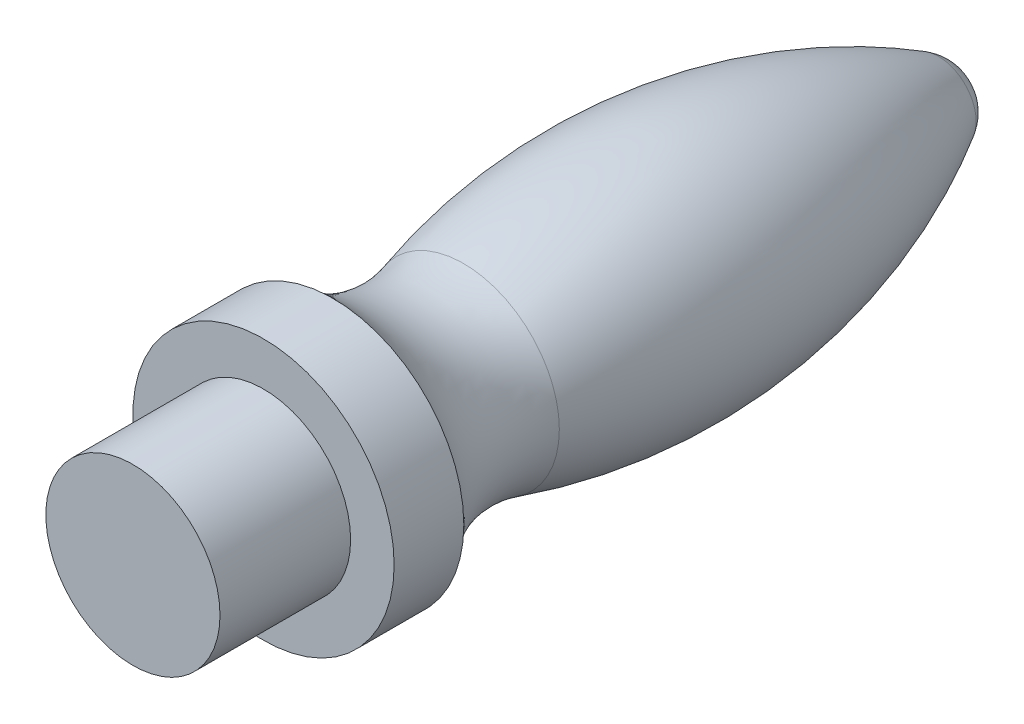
ISO-10303-21;
HEADER;
FILE_DESCRIPTION(('STEP AP214'),'2;1');
FILE_NAME('part.step','',(''),(''),'','','');
FILE_SCHEMA(('AUTOMOTIVE_DESIGN { 1 0 10303 214 1 1 1 1 }'));
ENDSEC;
DATA;
#1=APPLICATION_CONTEXT('core data for automotive mechanical design processes');
#2=APPLICATION_PROTOCOL_DEFINITION('international standard','automotive_design',2000,#1);
#3=PRODUCT_CONTEXT('',#1,'mechanical');
#4=PRODUCT('Part','Part','',(#3));
#5=PRODUCT_RELATED_PRODUCT_CATEGORY('part','',(#4));
#6=PRODUCT_DEFINITION_FORMATION('','',#4);
#7=PRODUCT_DEFINITION_CONTEXT('part definition',#1,'design');
#8=PRODUCT_DEFINITION('design','',#6,#7);
#9=PRODUCT_DEFINITION_SHAPE('','',#8);
#10=(LENGTH_UNIT() NAMED_UNIT(*) SI_UNIT(.MILLI.,.METRE.));
#11=(NAMED_UNIT(*) PLANE_ANGLE_UNIT() SI_UNIT($,.RADIAN.));
#12=(NAMED_UNIT(*) SI_UNIT($,.STERADIAN.) SOLID_ANGLE_UNIT());
#13=UNCERTAINTY_MEASURE_WITH_UNIT(LENGTH_MEASURE(1.E-05),#10,'distance_accuracy_value','');
#14=(GEOMETRIC_REPRESENTATION_CONTEXT(3) GLOBAL_UNCERTAINTY_ASSIGNED_CONTEXT((#13)) GLOBAL_UNIT_ASSIGNED_CONTEXT((#10,
#11,#12)) REPRESENTATION_CONTEXT('',''));
#15=CARTESIAN_POINT('',(0.,0.,0.));
#16=DIRECTION('',(0.,0.,1.));
#17=DIRECTION('',(1.,0.,0.));
#18=AXIS2_PLACEMENT_3D('',#15,#16,#17);
#19=CARTESIAN_POINT('',(0.,0.,-43.2663465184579));
#20=DIRECTION('',(0.,0.,1.));
#21=DIRECTION('',(0.,1.,0.));
#22=AXIS2_PLACEMENT_3D('',#19,#20,#21);
#23=SPHERICAL_SURFACE('',#22,5.);
#24=CARTESIAN_POINT('',(0.,0.,-45.7729711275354));
#25=DIRECTION('',(0.,0.,1.));
#26=DIRECTION('',(1.,0.,0.));
#27=AXIS2_PLACEMENT_3D('',#24,#25,#26);
#28=CIRCLE('',#27,4.32629553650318);
#29=CARTESIAN_POINT('',(4.32629553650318,0.,-45.7729711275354));
#30=VERTEX_POINT('',#29);
#31=EDGE_CURVE('E10',#30,#30,#28,.T.);
#32=ORIENTED_EDGE('',*,*,#31,.F.);
#33=EDGE_LOOP('',(#32));
#34=FACE_BOUND('',#33,.T.);
#35=ADVANCED_FACE('F29',(#34),#23,.T.);
#36=CARTESIAN_POINT('',(0.,0.,-10.6802266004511));
#37=DIRECTION('',(0.,0.,1.));
#38=DIRECTION('',(1.,0.,0.));
#39=AXIS2_PLACEMENT_3D('',#36,#37,#38);
#40=DEGENERATE_TOROIDAL_SURFACE('',#39,56.2418419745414,70.,.F.);
#41=CARTESIAN_POINT('',(0.,0.,8.76811348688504));
#42=DIRECTION('',(0.,0.,1.));
#43=DIRECTION('',(1.,0.,0.));
#44=AXIS2_PLACEMENT_3D('',#41,#42,#43);
#45=CIRCLE('',#44,11.0022065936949);
#46=CARTESIAN_POINT('',(11.0022065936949,0.,8.76811348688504));
#47=VERTEX_POINT('',#46);
#48=EDGE_CURVE('E35',#47,#47,#45,.T.);
#49=ORIENTED_EDGE('',*,*,#48,.F.);
#50=EDGE_LOOP('',(#49));
#51=FACE_BOUND('',#50,.T.);
#52=ORIENTED_EDGE('',*,*,#31,.T.);
#53=EDGE_LOOP('',(#52));
#54=FACE_BOUND('',#53,.T.);
#55=ADVANCED_FACE('F77',(#51,#54),#40,.F.);
#56=CARTESIAN_POINT('',(0.,0.,12.9356149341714));
#57=DIRECTION('',(0.,0.,1.));
#58=DIRECTION('',(1.,0.,0.));
#59=AXIS2_PLACEMENT_3D('',#56,#57,#58);
#60=TOROIDAL_SURFACE('',#59,25.4116455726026,15.);
#61=CARTESIAN_POINT('',(0.,0.,23.7336534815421));
#62=DIRECTION('',(0.,0.,1.));
#63=DIRECTION('',(1.,0.,0.));
#64=AXIS2_PLACEMENT_3D('',#61,#62,#63);
#65=CIRCLE('',#64,15.);
#66=CARTESIAN_POINT('',(15.,0.,23.7336534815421));
#67=VERTEX_POINT('',#66);
#68=EDGE_CURVE('E39',#67,#67,#65,.T.);
#69=ORIENTED_EDGE('',*,*,#68,.F.);
#70=EDGE_LOOP('',(#69));
#71=FACE_BOUND('',#70,.T.);
#72=ORIENTED_EDGE('',*,*,#48,.T.);
#73=EDGE_LOOP('',(#72));
#74=FACE_BOUND('',#73,.T.);
#75=ADVANCED_FACE('F72',(#71,#74),#60,.F.);
#76=CARTESIAN_POINT('',(0.,0.,68.4127456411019));
#77=DIRECTION('',(0.,0.,1.));
#78=DIRECTION('',(1.,0.,0.));
#79=AXIS2_PLACEMENT_3D('',#76,#77,#78);
#80=CYLINDRICAL_SURFACE('',#79,15.);
#81=CARTESIAN_POINT('',(0.,0.,31.7336534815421));
#82=DIRECTION('',(0.,0.,1.));
#83=DIRECTION('',(1.,0.,0.));
#84=AXIS2_PLACEMENT_3D('',#81,#82,#83);
#85=CIRCLE('',#84,15.);
#86=CARTESIAN_POINT('',(15.,0.,31.7336534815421));
#87=VERTEX_POINT('',#86);
#88=EDGE_CURVE('E43',#87,#87,#85,.T.);
#89=ORIENTED_EDGE('',*,*,#88,.F.);
#90=EDGE_LOOP('',(#89));
#91=FACE_BOUND('',#90,.T.);
#92=ORIENTED_EDGE('',*,*,#68,.T.);
#93=EDGE_LOOP('',(#92));
#94=FACE_BOUND('',#93,.T.);
#95=ADVANCED_FACE('F66',(#91,#94),#80,.T.);
#96=CARTESIAN_POINT('',(0.,10.,31.7336534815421));
#97=DIRECTION('',(0.,0.,-1.));
#98=DIRECTION('',(-1.,0.,0.));
#99=AXIS2_PLACEMENT_3D('',#96,#97,#98);
#100=PLANE('',#99);
#101=CARTESIAN_POINT('',(0.,0.,31.7336534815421));
#102=DIRECTION('',(0.,0.,1.));
#103=DIRECTION('',(1.,0.,0.));
#104=AXIS2_PLACEMENT_3D('',#101,#102,#103);
#105=CIRCLE('',#104,10.);
#106=CARTESIAN_POINT('',(10.,0.,31.7336534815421));
#107=VERTEX_POINT('',#106);
#108=EDGE_CURVE('E48',#107,#107,#105,.T.);
#109=ORIENTED_EDGE('',*,*,#108,.F.);
#110=EDGE_LOOP('',(#109));
#111=FACE_BOUND('',#110,.T.);
#112=ORIENTED_EDGE('',*,*,#88,.T.);
#113=EDGE_LOOP('',(#112));
#114=FACE_BOUND('',#113,.T.);
#115=ADVANCED_FACE('F60',(#111,#114),#100,.F.);
#116=CARTESIAN_POINT('',(0.,0.,68.4127456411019));
#117=DIRECTION('',(0.,0.,1.));
#118=DIRECTION('',(1.,0.,0.));
#119=AXIS2_PLACEMENT_3D('',#116,#117,#118);
#120=CYLINDRICAL_SURFACE('',#119,10.);
#121=CARTESIAN_POINT('',(0.,0.,46.7336534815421));
#122=DIRECTION('',(0.,0.,1.));
#123=DIRECTION('',(1.,0.,0.));
#124=AXIS2_PLACEMENT_3D('',#121,#122,#123);
#125=CIRCLE('',#124,10.);
#126=CARTESIAN_POINT('',(10.,0.,46.7336534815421));
#127=VERTEX_POINT('',#126);
#128=EDGE_CURVE('E51',#127,#127,#125,.T.);
#129=ORIENTED_EDGE('',*,*,#128,.F.);
#130=EDGE_LOOP('',(#129));
#131=FACE_BOUND('',#130,.T.);
#132=ORIENTED_EDGE('',*,*,#108,.T.);
#133=EDGE_LOOP('',(#132));
#134=FACE_BOUND('',#133,.T.);
#135=ADVANCED_FACE('F57',(#131,#134),#120,.T.);
#136=CARTESIAN_POINT('',(0.,0.,46.7336534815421));
#137=DIRECTION('',(0.,0.,-1.));
#138=DIRECTION('',(-1.,0.,0.));
#139=AXIS2_PLACEMENT_3D('',#136,#137,#138);
#140=PLANE('',#139);
#141=ORIENTED_EDGE('',*,*,#128,.T.);
#142=EDGE_LOOP('',(#141));
#143=FACE_BOUND('',#142,.T.);
#144=ADVANCED_FACE('F55',(#143),#140,.F.);
#145=CLOSED_SHELL('',(#35,#55,#75,#95,#115,#135,#144));
#146=MANIFOLD_SOLID_BREP('B2',#145);
#147=ADVANCED_BREP_SHAPE_REPRESENTATION('',(#18,#146),#14);
#148=SHAPE_DEFINITION_REPRESENTATION(#9,#147);
ENDSEC;
END-ISO-10303-21;
